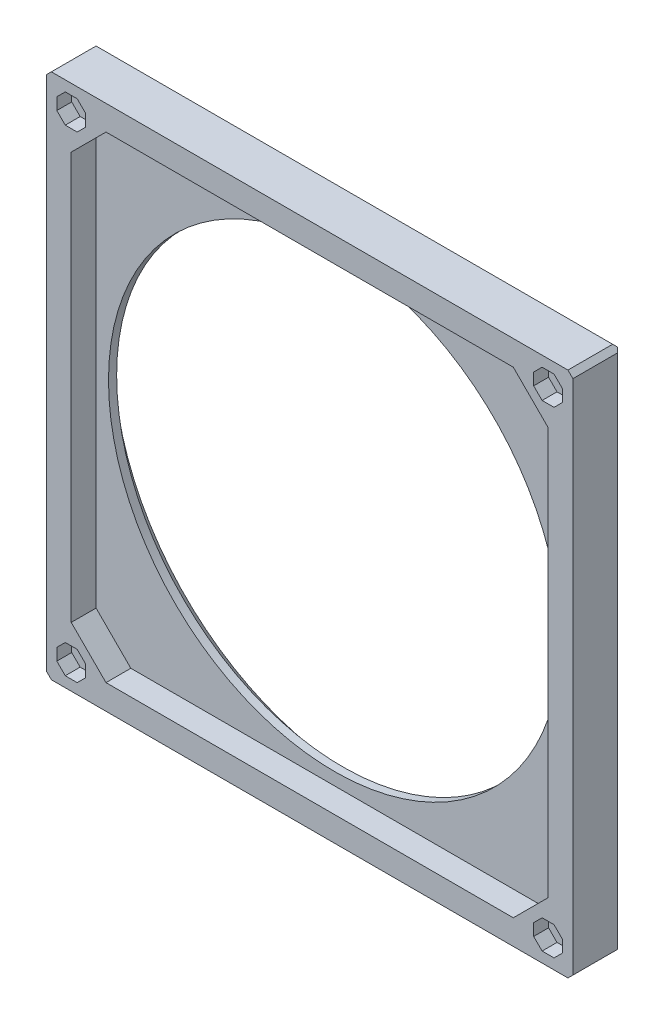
from build123d import *

# Parameters (mm, degrees)
SKETCH1_LARGER_DIA_W  = 106
SKETCH1_LARGER_DIA_H  = 106
BOSS_EXTRUDE1_DEPTH   = 5
SKETCH5_SMALLER_DIA_W = 106
SKETCH5_SMALLER_DIA_H = 106
SKETCH5_SMALLER_DIA_R = 45.5
BOSS_EXTRUDE2_DEPTH   = 5
CUT_EXTRUDE1_DEPTH    = 3
CHAMFER1_SIZE         = 4
CHAMFER1_SIZE2        = 3.356398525
CHAMFER2_SIZE         = 1
CHAMFER3_SIZE         = 1


with BuildPart() as part:
    # Sketch1 larger dia → Boss-Extrude1 (new body)
    with BuildSketch(Plane.XY):
        Rectangle(SKETCH1_LARGER_DIA_W, SKETCH1_LARGER_DIA_H)
        Polygon((-41, 48), (41, 48), (48, 41), (48, -41), (41, -48), (-41, -48), (-48, -41), (-48, 41), align=None, mode=Mode.SUBTRACT)
    extrude(amount=BOSS_EXTRUDE1_DEPTH)

    # Sketch5 smaller dia → Boss-Extrude2 (add)
    with BuildSketch(Plane(origin=(0, 0, 0), x_dir=(-1, 0, 0), z_dir=(0, 0, -1))):
        Rectangle(SKETCH5_SMALLER_DIA_W, SKETCH5_SMALLER_DIA_H)
        Circle(SKETCH5_SMALLER_DIA_R, mode=Mode.SUBTRACT)
    extrude(amount=BOSS_EXTRUDE2_DEPTH)

    # Sketch1 → Cut-Extrude1 (cut)
    with BuildSketch(Plane.XY.offset(5)):
        Polygon((-45.1, 46.798780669), (-45.1, 49.201219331), (-46.798780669, 50.9), (-49.201219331, 50.9), (-50.9, 49.201219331), (-50.9, 46.798780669), (-49.201219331, 45.1), (-46.798780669, 45.1), align=None)
        Polygon((-46.798780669, -45.1), (-45.1, -46.798780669), (-45.1, -49.201219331), (-46.798780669, -50.9), (-49.201219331, -50.9), (-50.9, -49.201219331), (-50.9, -46.798780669), (-49.201219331, -45.1), align=None)
        Polygon((46.798780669, 45.1), (45.1, 46.798780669), (45.1, 49.201219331), (46.798780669, 50.9), (49.201219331, 50.9), (50.9, 49.201219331), (50.9, 46.798780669), (49.201219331, 45.1), align=None)
        Polygon((45.1, -46.798780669), (45.1, -49.201219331), (46.798780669, -50.9), (49.201219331, -50.9), (50.9, -49.201219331), (50.9, -46.798780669), (49.201219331, -45.1), (46.798780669, -45.1), align=None)
    extrude(amount=-CUT_EXTRUDE1_DEPTH, mode=Mode.SUBTRACT)

    # Chamfer1
    chamfer1_edges = [part.edges().sort_by_distance(p)[0] for p in [
        (45.5, 0, -5),
    ]]
    chamfer1_side = [part.faces().sort_by_distance(p)[0] for p in [
        (0, 51.500933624, -5),
    ]]
    chamfer(chamfer1_edges, length=CHAMFER1_SIZE, length2=CHAMFER1_SIZE2, reference=chamfer1_side[0])

    # Chamfer2
    chamfer2_edges = [part.edges().sort_by_distance(p)[0] for p in [
        (53, 0, -5),
        (0, -53, -5),
        (-53, 0, -5),
        (0, 53, -5),
    ]]
    chamfer(chamfer2_edges, length=CHAMFER2_SIZE)

    # Chamfer3
    chamfer3_edges = [part.edges().sort_by_distance(p)[0] for p in [
        (-53, 53, 0.5),
        (53, 53, 0.5),
        (53, -53, 0.5),
        (-53, -53, 0.5),
    ]]
    chamfer(chamfer3_edges, length=CHAMFER3_SIZE)


solid = part.part
